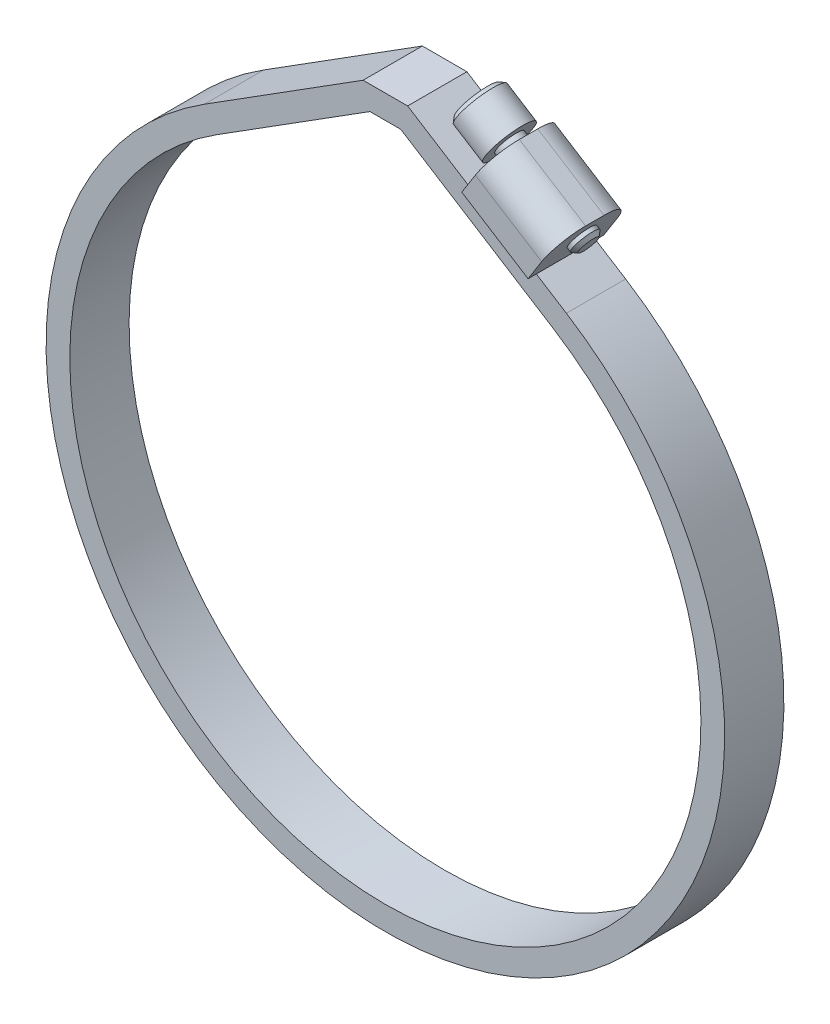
from build123d import *

# Parameters (mm, degrees)
EXTRUDE1_DEPTH     = 3.937
EXTRUDE3_DEPTH     = 5.0292
FILLET1_R          = 3.81
CHAMFER1_SIZE      = 0.5
CUT_EXTRUDE1_DEPTH = 2.5
WEB_EXTRUDE4_DEPTH = 7.874


with BuildPart() as part:
    # Sketch1 → Extrude1 (new, symmetric)
    with BuildSketch(Plane.XY):
        with BuildLine():
            Line((-24.040015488, 38.110959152), (-2.957501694, 51.4096))
            Line((-2.957501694, 51.4096), (2.957501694, 51.4096))
            Line((2.957501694, 51.4096), (24.040015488, 38.110959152))
            ThreePointArc((24.040015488, 38.110959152), (0, -45.0596), (-24.040015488, 38.110959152))
        make_face()
        with BuildLine():
            Line((-2.967587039, 50.682491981), (-23.714784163, 37.595365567))
            ThreePointArc((-23.714784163, 37.595365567), (0, -44.45), (23.714784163, 37.595365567))
            Line((23.714784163, 37.595365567), (2.967587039, 50.682491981))
            ThreePointArc((2.967587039, 50.682491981), (2.772638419, 50.770033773), (2.561047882, 50.8))
            Line((2.561047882, 50.8), (-2.561047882, 50.8))
            ThreePointArc((-2.561047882, 50.8), (-2.772638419, 50.770033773), (-2.967587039, 50.682491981))
        make_face(mode=Mode.SUBTRACT)
    extrude(amount=EXTRUDE1_DEPTH, both=True)



with BuildPart() as body_2:
    # Sketch4 → Revolve1 (revolve)
    with BuildSketch(Plane.XY, mode=Mode.PRIVATE) as revolve1_sk:
        Polygon((8.244319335, 52.819640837), (6.55040618, 50.134257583), (10.847019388, 47.423996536), (11.609280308, 48.632419), (22.103758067, 42.012606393), (23.035410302, 43.489567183), align=None)
    revolve(revolve1_sk.sketch.rotate(Axis((8.244319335, 52.819640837, 0), (-0.8457900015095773, 0.5335159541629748, 0)), 180), axis=Axis((8.244319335, 52.819640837, 0), (-0.8457900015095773, 0.5335159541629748, 0)))

    # Chamfer1
    chamfer1_edges = [body_2.edges().sort_by_distance(p)[0] for p in [
        (6.55040618, 50.134257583, 0),
        (22.103758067, 42.012606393, 0),
    ]]
    chamfer(chamfer1_edges, length=CHAMFER1_SIZE)

    # Sketch6 → Cut-Extrude1 (cut)
    with BuildSketch(Plane(origin=(-17.936802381, 11.314357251, 0), x_dir=(0, 0, 1), z_dir=(-0.8457900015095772, 0.5335159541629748, 0))):
        Polygon((0, 51.382201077), (-2, 50.227500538), (-2, 47.918099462), (0, 46.763398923), (2, 47.918099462), (2, 50.227500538), align=None)
    extrude(amount=-CUT_EXTRUDE1_DEPTH, mode=Mode.SUBTRACT)


with BuildPart() as body_3:
    # Sketch5 → Extrude3 (new, symmetric)
    with BuildSketch(Plane.XY):
        Polygon((11.245616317, 46.181539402), (15.080635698, 52.261247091), (23.883533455, 46.708466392), (20.048514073, 40.628758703), align=None)
    extrude(amount=EXTRUDE3_DEPTH, both=True)

    # Fillet1
    fillet1_edges = [body_3.edges().sort_by_distance(p)[0] for p in [
        (19.482084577, 49.484856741, 5.0292),
        (19.482084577, 49.484856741, -5.0292),
    ]]
    fillet(fillet1_edges, radius=FILLET1_R)


with BuildPart() as part_1:
    add(part.part)

    add(body_3.part)  # Web-Extrude4 merges body 3

    add(body_2.part)  # Web-Extrude4 merges body 2
    # Sketch7 → Web-Extrude4 (add)
    with BuildSketch(Plane.XY.offset(3.937)):
        with BuildLine():
            Line((23.714784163, 37.595365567), (2.967587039, 50.682491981))
            ThreePointArc((2.967587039, 50.682491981), (2.772638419, 50.770033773), (2.561047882, 50.8))
            Line((2.561047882, 50.8), (-2.561047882, 50.8))
            ThreePointArc((-2.561047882, 50.8), (-2.772638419, 50.770033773), (-2.967587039, 50.682491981))
            Line((-2.967587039, 50.682491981), (-23.714784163, 37.595365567))
            ThreePointArc((-23.714784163, 37.595365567), (0, -44.45), (23.714784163, 37.595365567))
        make_face()
        with BuildLine():
            Line((-2.047126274, 48.26), (-22.359653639, 35.447058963))
            ThreePointArc((-22.359653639, 35.447058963), (0, -41.91), (22.359653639, 35.447058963))
            Line((22.359653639, 35.447058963), (2.047126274, 48.26))
            Line((2.047126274, 48.26), (-2.047126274, 48.26))
        make_face(mode=Mode.SUBTRACT)
    extrude(amount=-WEB_EXTRUDE4_DEPTH)


solid = part_1.part
